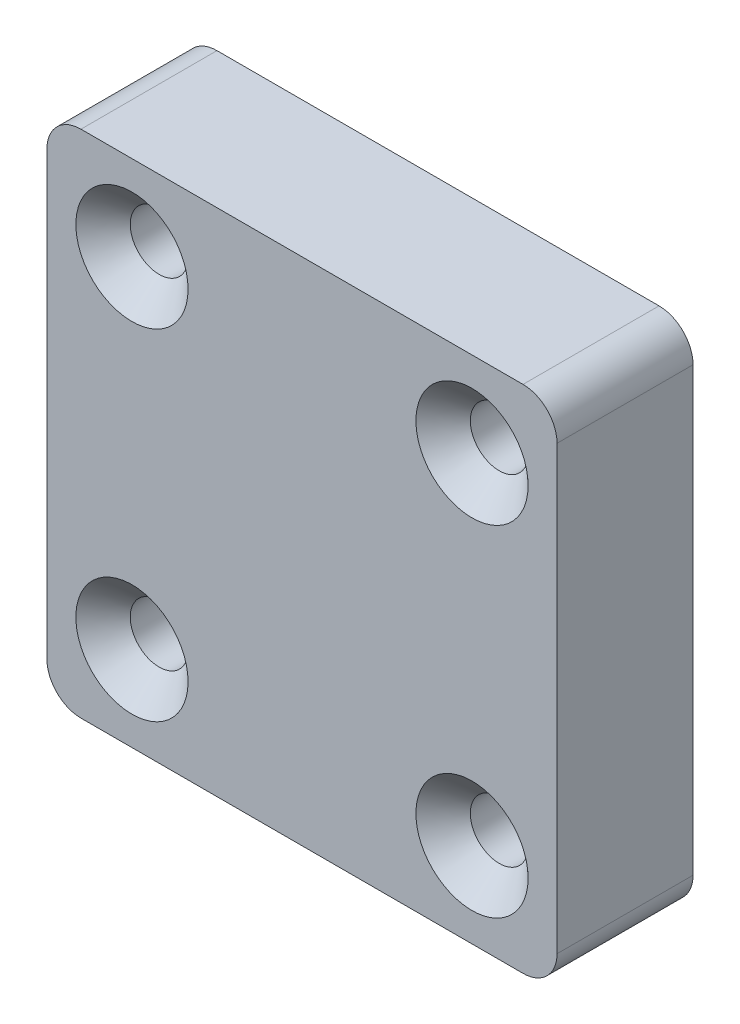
from build123d import *

# Parameters (mm, degrees)
SKETCH_1_W                   = 30
SKETCH_1_H                   = 30
EXTRUDE_1_DEPTH              = 10
HOLE_WIZARD_M3_1_D           = 3.4
HOLE_WIZARD_M3_1_CSINK_D     = 6.6
HOLE_WIZARD_M3_1_CSINK_ANGLE = 90
FILLET_1_R                   = 2
CUT_EXTRUDE_START            = -2
CUT_EXTRUDE_1_DEPTH          = 2


with BuildPart() as part:
    # Sketch 1 → Extrude 1 (new body)
    with BuildSketch(Plane.XY):
        Rectangle(SKETCH_1_W, SKETCH_1_H)
    extrude(amount=EXTRUDE_1_DEPTH)

    # Hole Wizard M3 _1 (through all)
    with Locations(Plane.XY.offset(10)):
        with Locations((-10, 10), (10, 10), (-10, -10), (10, -10)):
            CounterSinkHole(HOLE_WIZARD_M3_1_D / 2, HOLE_WIZARD_M3_1_CSINK_D / 2, counter_sink_angle=HOLE_WIZARD_M3_1_CSINK_ANGLE)

    # Fillet 1
    fillet_1_edges = [part.edges().sort_by_distance(p)[0] for p in [
        (15, -15, 5),
        (-15, -15, 5),
        (-15, 15, 5),
        (15, 15, 5),
    ]]
    fillet(fillet_1_edges, radius=FILLET_1_R)

    # Sketch 4 → Cut-Extrude 1 (cut)
    with BuildSketch(Plane(origin=(0, 0, 0), x_dir=(-1, 0, 0), z_dir=(0, 0, -1)).offset(CUT_EXTRUDE_START)):
        with BuildLine():
            Line((-13, -15), (13, -15))
            ThreePointArc((13, -15), (14.414213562, -14.414213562), (15, -13))
            Line((15, -13), (15, 13))
            ThreePointArc((15, 13), (14.414213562, 14.414213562), (13, 15))
            Line((13, 15), (-13, 15))
            ThreePointArc((-13, 15), (-14.414213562, 14.414213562), (-15, 13))
            Line((-15, 13), (-15, -13))
            ThreePointArc((-15, -13), (-14.414213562, -14.414213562), (-13, -15))
        make_face()
    extrude(amount=CUT_EXTRUDE_1_DEPTH, mode=Mode.SUBTRACT)


solid = part.part
